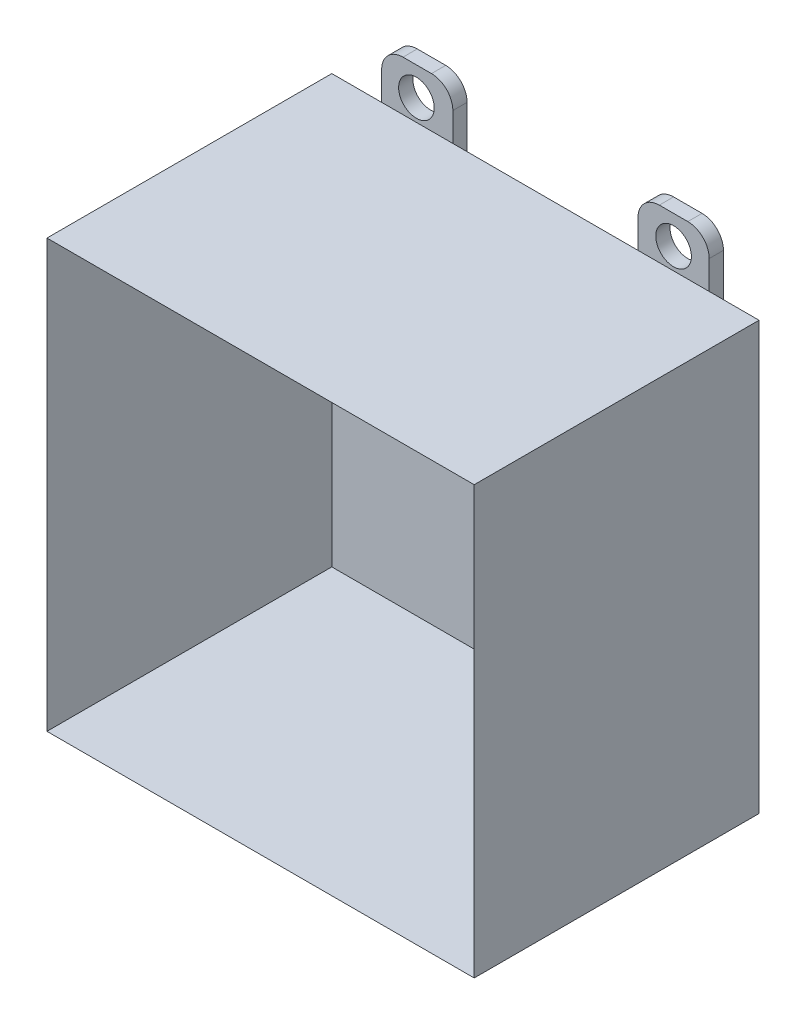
from build123d import *

# Parameters (mm, degrees)
SKETCH1_W             = 76.2
SKETCH1_H             = 76.2
BOSS_EXTRUDE1_DEPTH   = 50.8
SKETCH2_W             = 12.7
SKETCH2_H             = 17.78
BOSS_EXTRUDE2_DEPTH   = 2.54
BOSS_EXTRUDE2_2_DEPTH = 2.54
SKETCH3_R             = 3.175
CUT_EXTRUDE1_DEPTH    = 56.387144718
FILLET1_R             = 3.81
FILLET2_R             = 3.81


with BuildPart() as part:
    # Sketch1 → Boss-Extrude1 (new body)
    with BuildSketch(Plane.XY):
        Rectangle(SKETCH1_W, SKETCH1_H)
    extrude(amount=BOSS_EXTRUDE1_DEPTH)

    # DeleteFace1: 1 face struck out; the rest of the skin is kept as a surface, the solid goes
    deleteface1_1_drop = [part.part.faces().sort_by_distance(Vector(p))[0] for p in ((0, 0, 50.8),)]
    deleteface1_1 = Shell(part.part.faces() - deleteface1_1_drop)


with BuildPart() as part_2:
    # Sketch2 → Boss-Extrude2 (new body)
    with BuildSketch(Plane(origin=(0, 0, 0), x_dir=(-1, 0, 0), z_dir=(0, 0, -1))):
        with Locations((-22.86, 38.1)):
            Rectangle(SKETCH2_W, SKETCH2_H)
    extrude(amount=BOSS_EXTRUDE2_DEPTH)


with BuildPart() as body_2:
    # Sketch2 → Boss-Extrude2 2 (new body)
    with BuildSketch(Plane(origin=(0, 0, 0), x_dir=(-1, 0, 0), z_dir=(0, 0, -1))):
        with Locations((22.86, 38.1)):
            Rectangle(SKETCH2_W, SKETCH2_H)
    extrude(amount=BOSS_EXTRUDE2_2_DEPTH)


with BuildPart() as cut_extrude1_tool:
    # Sketch3 → Cut-Extrude1 (new, through all)
    with BuildSketch(Plane.XY):
        with Locations((-23.008085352, 41.91)):
            Circle(SKETCH3_R)
        with Locations((22.86, 41.91)):
            Circle(SKETCH3_R)
    extrude(amount=-CUT_EXTRUDE1_DEPTH)


with BuildPart() as part_2_1:
    add(part_2.part)

    # Cut-Extrude1: cut by cut_extrude1_tool
    add(cut_extrude1_tool.part, mode=Mode.SUBTRACT)

    # Fillet1
    fillet1_edges = [part_2_1.edges().sort_by_distance(p)[0] for p in [
        (29.21, 46.99, -1.27),
        (16.51, 46.99, -1.27),
    ]]
    fillet(fillet1_edges, radius=FILLET1_R)


with BuildPart() as body_2_1:
    add(body_2.part)

    # Cut-Extrude1: cut by cut_extrude1_tool
    add(cut_extrude1_tool.part, mode=Mode.SUBTRACT)

    # Fillet2
    fillet2_edges = [body_2_1.edges().sort_by_distance(p)[0] for p in [
        (-16.51, 46.99, -1.27),
        (-29.21, 46.99, -1.27),
    ]]
    fillet(fillet2_edges, radius=FILLET2_R)


solid = Compound([part_2_1.part, body_2_1.part])
